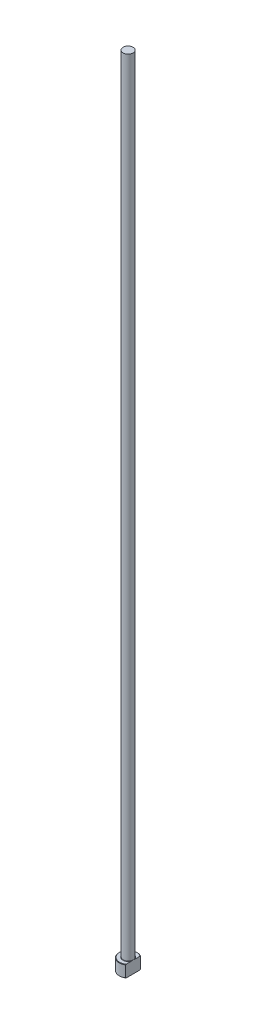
ISO-10303-21;
HEADER;
FILE_DESCRIPTION(('STEP AP214'),'2;1');
FILE_NAME('part.step','',(''),(''),'','','');
FILE_SCHEMA(('AUTOMOTIVE_DESIGN { 1 0 10303 214 1 1 1 1 }'));
ENDSEC;
DATA;
#1=APPLICATION_CONTEXT('core data for automotive mechanical design processes');
#2=APPLICATION_PROTOCOL_DEFINITION('international standard','automotive_design',2000,#1);
#3=PRODUCT_CONTEXT('',#1,'mechanical');
#4=PRODUCT('Part','Part','',(#3));
#5=PRODUCT_RELATED_PRODUCT_CATEGORY('part','',(#4));
#6=PRODUCT_DEFINITION_FORMATION('','',#4);
#7=PRODUCT_DEFINITION_CONTEXT('part definition',#1,'design');
#8=PRODUCT_DEFINITION('design','',#6,#7);
#9=PRODUCT_DEFINITION_SHAPE('','',#8);
#10=(LENGTH_UNIT() NAMED_UNIT(*) SI_UNIT(.MILLI.,.METRE.));
#11=(NAMED_UNIT(*) PLANE_ANGLE_UNIT() SI_UNIT($,.RADIAN.));
#12=(NAMED_UNIT(*) SI_UNIT($,.STERADIAN.) SOLID_ANGLE_UNIT());
#13=UNCERTAINTY_MEASURE_WITH_UNIT(LENGTH_MEASURE(1.E-05),#10,'distance_accuracy_value','');
#14=(GEOMETRIC_REPRESENTATION_CONTEXT(3) GLOBAL_UNCERTAINTY_ASSIGNED_CONTEXT((#13)) GLOBAL_UNIT_ASSIGNED_CONTEXT((#10,
#11,#12)) REPRESENTATION_CONTEXT('',''));
#15=CARTESIAN_POINT('',(0.,0.,0.));
#16=DIRECTION('',(0.,0.,1.));
#17=DIRECTION('',(1.,0.,0.));
#18=AXIS2_PLACEMENT_3D('',#15,#16,#17);
#19=CARTESIAN_POINT('',(0.,0.,0.));
#20=DIRECTION('',(0.,-1.,0.));
#21=DIRECTION('',(0.,0.,-1.));
#22=AXIS2_PLACEMENT_3D('',#19,#20,#21);
#23=PLANE('',#22);
#24=CARTESIAN_POINT('',(0.,0.,0.));
#25=DIRECTION('',(0.,-1.,0.));
#26=DIRECTION('',(0.,0.,-1.));
#27=AXIS2_PLACEMENT_3D('',#24,#25,#26);
#28=CIRCLE('',#27,4.29999999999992);
#29=CARTESIAN_POINT('',(2.49999999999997,0.,3.4985711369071));
#30=VERTEX_POINT('',#29);
#31=CARTESIAN_POINT('',(2.49999999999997,0.,-3.4985711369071));
#32=VERTEX_POINT('',#31);
#33=EDGE_CURVE('E98',#30,#32,#28,.T.);
#34=ORIENTED_EDGE('',*,*,#33,.T.);
#35=DIRECTION('',(0.,0.,1.));
#36=VECTOR('',#35,1.);
#37=CARTESIAN_POINT('',(2.49999999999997,0.,3.74165738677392));
#38=LINE('',#37,#36);
#39=EDGE_CURVE('E83',#32,#30,#38,.T.);
#40=ORIENTED_EDGE('',*,*,#39,.T.);
#41=EDGE_LOOP('',(#34,#40));
#42=FACE_BOUND('',#41,.T.);
#43=ADVANCED_FACE('F32',(#42),#23,.T.);
#44=CARTESIAN_POINT('',(0.,259.958771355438,0.));
#45=DIRECTION('',(0.,1.,0.));
#46=DIRECTION('',(0.,0.,1.));
#47=AXIS2_PLACEMENT_3D('',#44,#45,#46);
#48=CYLINDRICAL_SURFACE('',#47,4.49999999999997);
#49=CARTESIAN_POINT('',(0.,5.80000000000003,0.));
#50=DIRECTION('',(0.,1.,0.));
#51=DIRECTION('',(0.,0.,1.));
#52=AXIS2_PLACEMENT_3D('',#49,#50,#51);
#53=CIRCLE('',#52,4.49999999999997);
#54=CARTESIAN_POINT('',(2.49999999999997,5.80000000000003,3.74165738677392));
#55=VERTEX_POINT('',#54);
#56=CARTESIAN_POINT('',(2.49999999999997,5.80000000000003,-3.74165738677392));
#57=VERTEX_POINT('',#56);
#58=EDGE_CURVE('E104',#55,#57,#53,.F.);
#59=ORIENTED_EDGE('',*,*,#58,.T.);
#60=DIRECTION('',(0.,-1.,0.));
#61=VECTOR('',#60,1.);
#62=CARTESIAN_POINT('',(2.49999999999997,400.,-3.74165738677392));
#63=LINE('',#62,#61);
#64=CARTESIAN_POINT('',(2.49999999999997,0.199999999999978,-3.74165738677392));
#65=VERTEX_POINT('',#64);
#66=EDGE_CURVE('E183',#57,#65,#63,.T.);
#67=ORIENTED_EDGE('',*,*,#66,.T.);
#68=CARTESIAN_POINT('',(0.,0.199999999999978,0.));
#69=DIRECTION('',(0.,-1.,0.));
#70=DIRECTION('',(0.,0.,-1.));
#71=AXIS2_PLACEMENT_3D('',#68,#69,#70);
#72=CIRCLE('',#71,4.49999999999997);
#73=CARTESIAN_POINT('',(2.49999999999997,0.199999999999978,3.74165738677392));
#74=VERTEX_POINT('',#73);
#75=EDGE_CURVE('E100',#65,#74,#72,.F.);
#76=ORIENTED_EDGE('',*,*,#75,.T.);
#77=DIRECTION('',(0.,-1.,0.));
#78=VECTOR('',#77,1.);
#79=CARTESIAN_POINT('',(2.49999999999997,400.,3.74165738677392));
#80=LINE('',#79,#78);
#81=EDGE_CURVE('E93',#55,#74,#80,.T.);
#82=ORIENTED_EDGE('',*,*,#81,.F.);
#83=EDGE_LOOP('',(#59,#67,#76,#82));
#84=FACE_BOUND('',#83,.T.);
#85=ADVANCED_FACE('F158',(#84),#48,.T.);
#86=CARTESIAN_POINT('',(-4.49999999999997,6.,0.));
#87=DIRECTION('',(0.,1.,0.));
#88=DIRECTION('',(0.,0.,1.));
#89=AXIS2_PLACEMENT_3D('',#86,#87,#88);
#90=PLANE('',#89);
#91=CARTESIAN_POINT('',(0.,6.,0.));
#92=DIRECTION('',(0.,1.,0.));
#93=DIRECTION('',(0.,0.,1.));
#94=AXIS2_PLACEMENT_3D('',#91,#92,#93);
#95=CIRCLE('',#94,4.29999999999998);
#96=CARTESIAN_POINT('',(2.49999999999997,6.,-3.49857113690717));
#97=VERTEX_POINT('',#96);
#98=CARTESIAN_POINT('',(2.49999999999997,6.,3.49857113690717));
#99=VERTEX_POINT('',#98);
#100=EDGE_CURVE('E178',#97,#99,#95,.T.);
#101=ORIENTED_EDGE('',*,*,#100,.T.);
#102=DIRECTION('',(0.,0.,-1.));
#103=VECTOR('',#102,1.);
#104=CARTESIAN_POINT('',(2.49999999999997,6.,0.));
#105=LINE('',#104,#103);
#106=CARTESIAN_POINT('',(2.49999999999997,5.99999999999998,1.01980390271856));
#107=VERTEX_POINT('',#106);
#108=EDGE_CURVE('E57',#99,#107,#105,.T.);
#109=ORIENTED_EDGE('',*,*,#108,.T.);
#110=CARTESIAN_POINT('',(0.,6.,0.));
#111=DIRECTION('',(0.,1.,0.));
#112=DIRECTION('',(0.,0.,1.));
#113=AXIS2_PLACEMENT_3D('',#110,#111,#112);
#114=CIRCLE('',#113,2.69999999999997);
#115=CARTESIAN_POINT('',(2.49999999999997,5.99999999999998,-1.01980390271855));
#116=VERTEX_POINT('',#115);
#117=EDGE_CURVE('E107',#107,#116,#114,.F.);
#118=ORIENTED_EDGE('',*,*,#117,.T.);
#119=EDGE_CURVE('E136',#116,#97,#105,.T.);
#120=ORIENTED_EDGE('',*,*,#119,.T.);
#121=EDGE_LOOP('',(#101,#109,#118,#120));
#122=FACE_BOUND('',#121,.T.);
#123=ADVANCED_FACE('F147',(#122),#90,.T.);
#124=CARTESIAN_POINT('',(0.,6.00000000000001,0.));
#125=DIRECTION('',(0.,-1.,0.));
#126=DIRECTION('',(0.,0.,-1.));
#127=AXIS2_PLACEMENT_3D('',#124,#125,#126);
#128=CONICAL_SURFACE('',#127,4.29999999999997,0.785398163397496);
#129=ORIENTED_EDGE('',*,*,#58,.F.);
#130=CARTESIAN_POINT('',(2.49999999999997,1.69536803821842,8.233449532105));
#131=CARTESIAN_POINT('',(2.49999999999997,1.84159559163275,8.08062583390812));
#132=CARTESIAN_POINT('',(2.49999999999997,1.98764793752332,7.92763429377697));
#133=CARTESIAN_POINT('',(2.49999999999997,2.27932845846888,7.62124541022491));
#134=CARTESIAN_POINT('',(2.49999999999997,2.4249566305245,7.46784806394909));
#135=CARTESIAN_POINT('',(2.49999999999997,2.86116481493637,7.0068675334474));
#136=CARTESIAN_POINT('',(2.49999999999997,3.15099433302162,6.69857321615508));
#137=CARTESIAN_POINT('',(2.49999999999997,3.72884985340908,6.07807253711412));
#138=CARTESIAN_POINT('',(2.49999999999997,4.01686464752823,5.76585569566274));
#139=CARTESIAN_POINT('',(2.49999999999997,4.44539957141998,5.29439081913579));
#140=CARTESIAN_POINT('',(2.49999999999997,4.58765535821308,5.1367216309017));
#141=CARTESIAN_POINT('',(2.49999999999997,4.87066186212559,4.8200396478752));
#142=CARTESIAN_POINT('',(2.49999999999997,5.011412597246,4.66102686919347));
#143=CARTESIAN_POINT('',(2.49999999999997,5.29570787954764,4.33582683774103));
#144=CARTESIAN_POINT('',(2.49999999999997,5.43918418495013,4.16957975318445));
#145=CARTESIAN_POINT('',(2.49999999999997,5.72327592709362,3.83461659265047));
#146=CARTESIAN_POINT('',(2.49999999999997,5.86389099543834,3.66590020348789));
#147=CARTESIAN_POINT('',(2.49999999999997,6.14107420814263,3.32513857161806));
#148=CARTESIAN_POINT('',(2.49999999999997,6.27764223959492,3.15309323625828));
#149=CARTESIAN_POINT('',(2.49999999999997,6.47795110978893,2.89156777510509));
#150=CARTESIAN_POINT('',(2.49999999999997,6.5439576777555,2.80382460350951));
#151=CARTESIAN_POINT('',(2.49999999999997,6.67408242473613,2.62695176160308));
#152=CARTESIAN_POINT('',(2.49999999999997,6.73820069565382,2.5378221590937));
#153=CARTESIAN_POINT('',(2.49999999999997,6.87152528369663,2.34725612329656));
#154=CARTESIAN_POINT('',(2.49999999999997,6.94043579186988,2.24561149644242));
#155=CARTESIAN_POINT('',(2.49999999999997,7.07436956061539,2.0398042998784));
#156=CARTESIAN_POINT('',(2.49999999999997,7.13939350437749,1.93564217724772));
#157=CARTESIAN_POINT('',(2.49999999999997,7.26425850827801,1.72423874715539));
#158=CARTESIAN_POINT('',(2.49999999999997,7.32410048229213,1.61699798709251));
#159=CARTESIAN_POINT('',(2.49999999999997,7.43673687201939,1.39892979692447));
#160=CARTESIAN_POINT('',(2.49999999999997,7.48953435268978,1.28810395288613));
#161=CARTESIAN_POINT('',(2.49999999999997,7.60157711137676,1.02468144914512));
#162=CARTESIAN_POINT('',(2.49999999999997,7.65714985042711,0.870425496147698));
#163=CARTESIAN_POINT('',(2.49999999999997,7.72191807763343,0.634205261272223));
#164=CARTESIAN_POINT('',(2.49999999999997,7.74039604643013,0.554773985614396));
#165=CARTESIAN_POINT('',(2.49999999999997,7.77027635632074,0.394570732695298));
#166=CARTESIAN_POINT('',(2.49999999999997,7.78167951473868,0.313798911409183));
#167=CARTESIAN_POINT('',(2.49999999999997,7.79679993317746,0.150603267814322));
#168=CARTESIAN_POINT('',(2.49999999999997,7.80042867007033,0.0681710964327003));
#169=CARTESIAN_POINT('',(2.49999999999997,7.79949026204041,-0.0966436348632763));
#170=CARTESIAN_POINT('',(2.49999999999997,7.79492331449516,-0.179026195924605));
#171=CARTESIAN_POINT('',(2.49999999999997,7.77788997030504,-0.343090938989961));
#172=CARTESIAN_POINT('',(2.49999999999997,7.76541077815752,-0.424771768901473));
#173=CARTESIAN_POINT('',(2.49999999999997,7.73330588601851,-0.586708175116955));
#174=CARTESIAN_POINT('',(2.49999999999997,7.71367845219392,-0.66696340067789));
#175=CARTESIAN_POINT('',(2.49999999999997,7.65833470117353,-0.860438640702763));
#176=CARTESIAN_POINT('',(2.49999999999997,7.61933642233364,-0.972715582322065));
#177=CARTESIAN_POINT('',(2.49999999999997,7.53162689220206,-1.19338710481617));
#178=CARTESIAN_POINT('',(2.49999999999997,7.48290892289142,-1.30177893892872));
#179=CARTESIAN_POINT('',(2.49999999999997,7.37798916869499,-1.51554087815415));
#180=CARTESIAN_POINT('',(2.49999999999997,7.32174953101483,-1.62089218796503));
#181=CARTESIAN_POINT('',(2.49999999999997,7.23334776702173,-1.77656150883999));
#182=CARTESIAN_POINT('',(2.49999999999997,7.20321149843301,-1.82805098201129));
#183=CARTESIAN_POINT('',(2.49999999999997,7.14176188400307,-1.93032073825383));
#184=CARTESIAN_POINT('',(2.49999999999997,7.11044858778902,-1.98110105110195));
#185=CARTESIAN_POINT('',(2.49999999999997,7.0042870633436,-2.14944611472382));
#186=CARTESIAN_POINT('',(2.49999999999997,6.92717470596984,-2.26558431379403));
#187=CARTESIAN_POINT('',(2.49999999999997,6.76891329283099,-2.49508800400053));
#188=CARTESIAN_POINT('',(2.49999999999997,6.68776326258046,-2.60845281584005));
#189=CARTESIAN_POINT('',(2.49999999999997,6.52238824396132,-2.83304153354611));
#190=CARTESIAN_POINT('',(2.49999999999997,6.43816097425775,-2.94426375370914));
#191=CARTESIAN_POINT('',(2.49999999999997,6.26739791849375,-3.1649260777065));
#192=CARTESIAN_POINT('',(2.49999999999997,6.18086198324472,-3.27436606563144));
#193=CARTESIAN_POINT('',(2.49999999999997,6.00577178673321,-3.49207549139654));
#194=CARTESIAN_POINT('',(2.49999999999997,5.91721294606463,-3.60034123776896));
#195=CARTESIAN_POINT('',(2.49999999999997,5.73865921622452,-3.81568349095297));
#196=CARTESIAN_POINT('',(2.49999999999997,5.64866429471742,-3.92275997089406));
#197=CARTESIAN_POINT('',(2.49999999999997,5.37704561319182,-4.24242567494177));
#198=CARTESIAN_POINT('',(2.49999999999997,5.19370393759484,-4.45355444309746));
#199=CARTESIAN_POINT('',(2.49999999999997,4.82367634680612,-4.87338717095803));
#200=CARTESIAN_POINT('',(2.49999999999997,4.63698598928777,-5.08208719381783));
#201=CARTESIAN_POINT('',(2.49999999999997,4.26138721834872,-5.49751911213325));
#202=CARTESIAN_POINT('',(2.49999999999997,4.07247857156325,-5.70425079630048));
#203=CARTESIAN_POINT('',(2.49999999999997,3.69329624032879,-6.11595801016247));
#204=CARTESIAN_POINT('',(2.49999999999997,3.50302465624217,-6.32093547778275));
#205=CARTESIAN_POINT('',(2.49999999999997,3.12126439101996,-6.72975403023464));
#206=CARTESIAN_POINT('',(2.49999999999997,2.92977570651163,-6.93359511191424));
#207=CARTESIAN_POINT('',(2.49999999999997,2.65119470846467,-7.2287714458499));
#208=CARTESIAN_POINT('',(2.49999999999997,2.56447790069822,-7.32046158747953));
#209=CARTESIAN_POINT('',(2.49999999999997,2.39085496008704,-7.50369470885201));
#210=CARTESIAN_POINT('',(2.49999999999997,2.30394879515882,-7.59523765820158));
#211=CARTESIAN_POINT('',(2.49999999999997,2.13016920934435,-7.77797738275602));
#212=CARTESIAN_POINT('',(2.49999999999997,2.04329612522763,-7.86917447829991));
#213=CARTESIAN_POINT('',(2.49999999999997,1.86942568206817,-8.0514176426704));
#214=CARTESIAN_POINT('',(2.49999999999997,1.78242834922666,-8.14246373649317));
#215=CARTESIAN_POINT('',(2.49999999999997,1.69536803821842,-8.233449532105));
#216=B_SPLINE_CURVE_WITH_KNOTS('',3,(#130,#131,#132,#133,#134,#135,#136,#137,#138,#139,#140,
#141,#142,#143,#144,#145,#146,#147,#148,#149,#150,#151,#152,#153,#154,#155,#156,#157,#158,#159,
#160,#161,#162,#163,#164,#165,#166,#167,#168,#169,#170,#171,#172,#173,#174,#175,#176,#177,#178,
#179,#180,#181,#182,#183,#184,#185,#186,#187,#188,#189,#190,#191,#192,#193,#194,#195,#196,#197,
#198,#199,#200,#201,#202,#203,#204,#205,#206,#207,#208,#209,#210,#211,#212,#213,#214,#215),
.UNSPECIFIED.,.F.,.F.,(4,2,2,2,2,2,2,2,2,2,2,2,2,2,2,2,2,2,2,2,2,2,2,2,2,2,2,2,2,2,2,2,2,2,2,2,
2,2,2,2,2,2,4),(0.,0.63453779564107,1.26908006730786,2.53848610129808,3.81276948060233,
4.44983884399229,5.08690057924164,5.74567154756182,6.40452680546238,7.06340042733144,
7.39277668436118,7.72213688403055,8.09047335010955,8.45874487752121,8.82695132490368,
9.19499704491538,9.68515232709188,9.92954493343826,10.1739093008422,10.4210416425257,
10.6681680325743,10.9156950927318,11.163282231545,11.5192140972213,11.8753928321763,
12.2334366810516,12.4124062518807,12.591368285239,13.0094573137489,13.427647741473,
13.8461547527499,14.2646888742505,14.6842890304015,15.1038986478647,15.942718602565,
16.7827484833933,17.6228675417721,18.4618914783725,19.300917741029,19.6795229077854,
20.0581981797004,20.4360532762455,20.8138378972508),.UNSPECIFIED.);
#217=EDGE_CURVE('E135',#55,#99,#216,.T.);
#218=ORIENTED_EDGE('',*,*,#217,.T.);
#219=ORIENTED_EDGE('',*,*,#100,.F.);
#220=EDGE_CURVE('E127',#97,#57,#216,.T.);
#221=ORIENTED_EDGE('',*,*,#220,.T.);
#222=EDGE_LOOP('',(#129,#218,#219,#221));
#223=FACE_BOUND('',#222,.T.);
#224=ADVANCED_FACE('F143',(#223),#128,.T.);
#225=CARTESIAN_POINT('',(0.,0.199999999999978,0.));
#226=DIRECTION('',(0.,1.,0.));
#227=DIRECTION('',(0.,0.,1.));
#228=AXIS2_PLACEMENT_3D('',#225,#226,#227);
#229=CONICAL_SURFACE('',#228,4.49999999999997,0.785398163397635);
#230=ORIENTED_EDGE('',*,*,#75,.F.);
#231=CARTESIAN_POINT('',(2.49999999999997,4.30463196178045,-8.233449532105));
#232=CARTESIAN_POINT('',(2.49999999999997,4.15840440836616,-8.08062583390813));
#233=CARTESIAN_POINT('',(2.49999999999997,4.01235206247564,-7.92763429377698));
#234=CARTESIAN_POINT('',(2.49999999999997,3.72067154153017,-7.62124541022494));
#235=CARTESIAN_POINT('',(2.49999999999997,3.5750433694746,-7.46784806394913));
#236=CARTESIAN_POINT('',(2.49999999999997,3.13883518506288,-7.00686753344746));
#237=CARTESIAN_POINT('',(2.49999999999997,2.84900566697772,-6.69857321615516));
#238=CARTESIAN_POINT('',(2.49999999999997,2.27115014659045,-6.07807253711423));
#239=CARTESIAN_POINT('',(2.49999999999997,1.98313535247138,-5.76585569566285));
#240=CARTESIAN_POINT('',(2.49999999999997,1.55460042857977,-5.29439081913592));
#241=CARTESIAN_POINT('',(2.49999999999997,1.41234464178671,-5.13672163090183));
#242=CARTESIAN_POINT('',(2.49999999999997,1.12933813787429,-4.82003964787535));
#243=CARTESIAN_POINT('',(2.49999999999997,0.988587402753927,-4.66102686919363));
#244=CARTESIAN_POINT('',(2.49999999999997,0.704292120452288,-4.33582683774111));
#245=CARTESIAN_POINT('',(2.49999999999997,0.560815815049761,-4.16957975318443));
#246=CARTESIAN_POINT('',(2.49999999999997,0.276724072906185,-3.83461659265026));
#247=CARTESIAN_POINT('',(2.49999999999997,0.136109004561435,-3.66590020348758));
#248=CARTESIAN_POINT('',(2.49999999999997,-0.141074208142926,-3.32513857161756));
#249=CARTESIAN_POINT('',(2.49999999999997,-0.277642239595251,-3.15309323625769));
#250=CARTESIAN_POINT('',(2.49999999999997,-0.477951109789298,-2.89156777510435));
#251=CARTESIAN_POINT('',(2.49999999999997,-0.543957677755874,-2.80382460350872));
#252=CARTESIAN_POINT('',(2.49999999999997,-0.674082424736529,-2.62695176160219));
#253=CARTESIAN_POINT('',(2.49999999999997,-0.738200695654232,-2.53782215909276));
#254=CARTESIAN_POINT('',(2.49999999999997,-0.871525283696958,-2.34725612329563));
#255=CARTESIAN_POINT('',(2.49999999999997,-0.940435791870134,-2.24561149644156));
#256=CARTESIAN_POINT('',(2.49999999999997,-1.07436956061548,-2.03980429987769));
#257=CARTESIAN_POINT('',(2.49999999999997,-1.1393935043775,-1.93564217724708));
#258=CARTESIAN_POINT('',(2.49999999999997,-1.26425850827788,-1.7242387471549));
#259=CARTESIAN_POINT('',(2.49999999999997,-1.32410048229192,-1.61699798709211));
#260=CARTESIAN_POINT('',(2.49999999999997,-1.43673687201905,-1.39892979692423));
#261=CARTESIAN_POINT('',(2.49999999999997,-1.48953435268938,-1.28810395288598));
#262=CARTESIAN_POINT('',(2.49999999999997,-1.6015771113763,-1.024681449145));
#263=CARTESIAN_POINT('',(2.49999999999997,-1.65714985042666,-0.870425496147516));
#264=CARTESIAN_POINT('',(2.49999999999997,-1.72191807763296,-0.634205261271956));
#265=CARTESIAN_POINT('',(2.49999999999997,-1.74039604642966,-0.5547739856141));
#266=CARTESIAN_POINT('',(2.49999999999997,-1.77027635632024,-0.394570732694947));
#267=CARTESIAN_POINT('',(2.49999999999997,-1.78167951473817,-0.313798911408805));
#268=CARTESIAN_POINT('',(2.49999999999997,-1.79679993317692,-0.150603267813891));
#269=CARTESIAN_POINT('',(2.49999999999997,-1.80042867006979,-0.0681710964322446));
#270=CARTESIAN_POINT('',(2.49999999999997,-1.79949026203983,0.0966436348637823));
#271=CARTESIAN_POINT('',(2.49999999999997,-1.79492331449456,0.179026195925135));
#272=CARTESIAN_POINT('',(2.49999999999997,-1.77788997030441,0.343090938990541));
#273=CARTESIAN_POINT('',(2.49999999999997,-1.76541077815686,0.424771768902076));
#274=CARTESIAN_POINT('',(2.49999999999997,-1.73330588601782,0.586708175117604));
#275=CARTESIAN_POINT('',(2.49999999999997,-1.71367845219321,0.666963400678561));
#276=CARTESIAN_POINT('',(2.49999999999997,-1.65833470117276,0.860438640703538));
#277=CARTESIAN_POINT('',(2.49999999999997,-1.61933642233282,0.972715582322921));
#278=CARTESIAN_POINT('',(2.49999999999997,-1.53162689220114,1.19338710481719));
#279=CARTESIAN_POINT('',(2.49999999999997,-1.48290892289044,1.30177893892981));
#280=CARTESIAN_POINT('',(2.49999999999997,-1.3779891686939,1.5155408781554));
#281=CARTESIAN_POINT('',(2.49999999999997,-1.32174953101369,1.62089218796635));
#282=CARTESIAN_POINT('',(2.49999999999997,-1.2333477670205,1.77656150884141));
#283=CARTESIAN_POINT('',(2.49999999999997,-1.20321149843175,1.82805098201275));
#284=CARTESIAN_POINT('',(2.49999999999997,-1.14176188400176,1.93032073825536));
#285=CARTESIAN_POINT('',(2.49999999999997,-1.11044858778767,1.98110105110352));
#286=CARTESIAN_POINT('',(2.49999999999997,-1.00428706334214,2.14944611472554));
#287=CARTESIAN_POINT('',(2.49999999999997,-0.927174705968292,2.26558431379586));
#288=CARTESIAN_POINT('',(2.49999999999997,-0.768913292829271,2.49508800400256));
#289=CARTESIAN_POINT('',(2.49999999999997,-0.687763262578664,2.6084528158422));
#290=CARTESIAN_POINT('',(2.49999999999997,-0.522388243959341,2.83304153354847));
#291=CARTESIAN_POINT('',(2.49999999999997,-0.438160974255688,2.94426375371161));
#292=CARTESIAN_POINT('',(2.49999999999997,-0.267397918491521,3.16492607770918));
#293=CARTESIAN_POINT('',(2.49999999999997,-0.180861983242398,3.27436606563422));
#294=CARTESIAN_POINT('',(2.49999999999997,-0.00577178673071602,3.49207549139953));
#295=CARTESIAN_POINT('',(2.49999999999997,0.0827870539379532,3.60034123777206));
#296=CARTESIAN_POINT('',(2.49999999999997,0.261340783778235,3.81568349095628));
#297=CARTESIAN_POINT('',(2.49999999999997,0.351335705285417,3.92275997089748));
#298=CARTESIAN_POINT('',(2.49999999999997,0.622954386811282,4.2424256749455));
#299=CARTESIAN_POINT('',(2.49999999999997,0.806296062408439,4.45355444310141));
#300=CARTESIAN_POINT('',(2.49999999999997,1.1763236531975,4.8733871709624));
#301=CARTESIAN_POINT('',(2.49999999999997,1.36301401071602,5.0820871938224));
#302=CARTESIAN_POINT('',(2.49999999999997,1.73861278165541,5.49751911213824));
#303=CARTESIAN_POINT('',(2.49999999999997,1.92752142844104,5.70425079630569));
#304=CARTESIAN_POINT('',(2.49999999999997,2.30670375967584,6.1159580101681));
#305=CARTESIAN_POINT('',(2.49999999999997,2.49697534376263,6.32093547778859));
#306=CARTESIAN_POINT('',(2.49999999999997,2.87873560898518,6.72975403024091));
#307=CARTESIAN_POINT('',(2.49999999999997,3.07022429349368,6.93359511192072));
#308=CARTESIAN_POINT('',(2.49999999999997,3.34880529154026,7.22877144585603));
#309=CARTESIAN_POINT('',(2.49999999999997,3.43552209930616,7.3204615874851));
#310=CARTESIAN_POINT('',(2.49999999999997,3.60914503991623,7.50369470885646));
#311=CARTESIAN_POINT('',(2.49999999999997,3.69605120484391,7.59523765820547));
#312=CARTESIAN_POINT('',(2.49999999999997,3.86983079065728,7.77797738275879));
#313=CARTESIAN_POINT('',(2.49999999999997,3.95670387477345,7.86917447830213));
#314=CARTESIAN_POINT('',(2.49999999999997,4.1305743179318,8.05141764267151));
#315=CARTESIAN_POINT('',(2.49999999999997,4.21757165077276,8.14246373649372));
#316=CARTESIAN_POINT('',(2.49999999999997,4.30463196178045,8.233449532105));
#317=B_SPLINE_CURVE_WITH_KNOTS('',3,(#231,#232,#233,#234,#235,#236,#237,#238,#239,#240,#241,
#242,#243,#244,#245,#246,#247,#248,#249,#250,#251,#252,#253,#254,#255,#256,#257,#258,#259,#260,
#261,#262,#263,#264,#265,#266,#267,#268,#269,#270,#271,#272,#273,#274,#275,#276,#277,#278,#279,
#280,#281,#282,#283,#284,#285,#286,#287,#288,#289,#290,#291,#292,#293,#294,#295,#296,#297,#298,
#299,#300,#301,#302,#303,#304,#305,#306,#307,#308,#309,#310,#311,#312,#313,#314,#315,#316),
.UNSPECIFIED.,.F.,.F.,(4,2,2,2,2,2,2,2,2,2,2,2,2,2,2,2,2,2,2,2,2,2,2,2,2,2,2,2,2,2,2,2,2,2,2,2,
2,2,2,2,2,2,4),(0.,0.634537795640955,1.26908006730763,2.53848610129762,3.81276948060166,
4.44983884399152,5.08690057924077,5.74567154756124,6.40452680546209,7.06340042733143,
7.39277668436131,7.72213688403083,8.09047335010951,8.45874487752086,8.82695132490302,
9.19499704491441,9.68515232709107,9.92954493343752,10.1739093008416,10.4210416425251,
10.6681680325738,10.9156950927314,11.1632822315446,11.5192140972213,11.8753928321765,
12.2334366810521,12.4124062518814,12.5913682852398,13.00945731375,13.4276477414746,
13.8461547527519,14.2646888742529,14.6842890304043,15.1038986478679,15.9427186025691,
16.7827484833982,17.6228675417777,18.4618914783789,19.3009177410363,19.6795229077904,
20.058198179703,20.4360532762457,20.8138378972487),.UNSPECIFIED.);
#318=EDGE_CURVE('E86',#65,#32,#317,.T.);
#319=ORIENTED_EDGE('',*,*,#318,.T.);
#320=ORIENTED_EDGE('',*,*,#33,.F.);
#321=EDGE_CURVE('E89',#30,#74,#317,.T.);
#322=ORIENTED_EDGE('',*,*,#321,.T.);
#323=EDGE_LOOP('',(#230,#319,#320,#322));
#324=FACE_BOUND('',#323,.T.);
#325=ADVANCED_FACE('F97',(#324),#229,.T.);
#326=CARTESIAN_POINT('',(0.,6.19999999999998,0.));
#327=DIRECTION('',(0.,1.,0.));
#328=DIRECTION('',(0.,0.,1.));
#329=AXIS2_PLACEMENT_3D('',#326,#327,#328);
#330=TOROIDAL_SURFACE('',#329,2.69999999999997,0.2);
#331=CARTESIAN_POINT('',(2.49999999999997,6.19999999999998,0.));
#332=CARTESIAN_POINT('',(2.49999999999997,6.20000050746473,5.29061779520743E-11));
#333=CARTESIAN_POINT('',(2.49999999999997,6.20000101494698,-1.70517167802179E-07));
#334=CARTESIAN_POINT('',(2.49999999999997,6.20000196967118,-6.59443828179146E-07));
#335=CARTESIAN_POINT('',(2.49999999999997,6.20000240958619,-9.87883952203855E-07));
#336=CARTESIAN_POINT('',(2.49999999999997,6.20000331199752,-1.77246896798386E-06));
#337=CARTESIAN_POINT('',(2.49999999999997,6.20000376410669,-2.24097233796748E-06));
#338=CARTESIAN_POINT('',(2.49999999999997,6.20000458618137,-3.22186062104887E-06));
#339=CARTESIAN_POINT('',(2.49999999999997,6.20000495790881,-3.73286591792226E-06));
#340=CARTESIAN_POINT('',(2.49999999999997,6.20000630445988,-5.67453790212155E-06));
#341=CARTESIAN_POINT('',(2.49999999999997,6.20000720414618,-7.15943636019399E-06));
#342=CARTESIAN_POINT('',(2.49999999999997,6.2000087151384,-1.01304384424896E-05));
#343=CARTESIAN_POINT('',(2.49999999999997,6.20000934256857,-1.16087238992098E-05));
#344=CARTESIAN_POINT('',(2.49999999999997,6.2000119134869,-1.77555557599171E-05));
#345=CARTESIAN_POINT('',(2.49999999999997,6.20001378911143,-2.24564508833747E-05));
#346=CARTESIAN_POINT('',(2.49999999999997,6.20001661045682,-3.14167104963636E-05));
#347=CARTESIAN_POINT('',(2.49999999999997,6.20001764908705,-3.56468505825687E-05));
#348=CARTESIAN_POINT('',(2.49999999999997,6.20002511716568,-6.67543466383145E-05));
#349=CARTESIAN_POINT('',(2.49999999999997,6.20003067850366,-9.37930231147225E-05));
#350=CARTESIAN_POINT('',(2.49999999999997,6.20005501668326,-0.000200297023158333));
#351=CARTESIAN_POINT('',(2.49999999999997,6.20007833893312,-0.000278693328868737));
#352=CARTESIAN_POINT('',(2.49999999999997,6.20016883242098,-0.000588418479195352));
#353=CARTESIAN_POINT('',(2.49999999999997,6.20023298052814,-0.000820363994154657));
#354=CARTESIAN_POINT('',(2.49999999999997,6.20048923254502,-0.00173961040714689));
#355=CARTESIAN_POINT('',(2.49999999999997,6.20068508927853,-0.00242612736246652));
#356=CARTESIAN_POINT('',(2.49999999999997,6.20149752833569,-0.00528196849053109));
#357=CARTESIAN_POINT('',(2.49999999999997,6.20210941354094,-0.00745227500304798));
#358=CARTESIAN_POINT('',(2.49999999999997,6.20774599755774,-0.0274346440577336));
#359=CARTESIAN_POINT('',(2.49999999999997,6.21279017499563,-0.0452427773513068));
#360=CARTESIAN_POINT('',(2.49999999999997,6.22264347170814,-0.0801677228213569));
#361=CARTESIAN_POINT('',(2.49999999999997,6.22745402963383,-0.0972841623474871));
#362=CARTESIAN_POINT('',(2.49999999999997,6.23763483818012,-0.133672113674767));
#363=CARTESIAN_POINT('',(2.49999999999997,6.24299975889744,-0.152945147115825));
#364=CARTESIAN_POINT('',(2.49999999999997,6.25370389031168,-0.19172222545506));
#365=CARTESIAN_POINT('',(2.49999999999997,6.25904219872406,-0.211226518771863));
#366=CARTESIAN_POINT('',(2.49999999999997,6.27184445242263,-0.258540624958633));
#367=CARTESIAN_POINT('',(2.49999999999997,6.27925018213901,-0.286366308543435));
#368=CARTESIAN_POINT('',(2.49999999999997,6.2935514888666,-0.341371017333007));
#369=CARTESIAN_POINT('',(2.49999999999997,6.30045534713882,-0.368547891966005));
#370=CARTESIAN_POINT('',(2.49999999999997,6.3199112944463,-0.447507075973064));
#371=CARTESIAN_POINT('',(2.49999999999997,6.3319536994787,-0.499417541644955));
#372=CARTESIAN_POINT('',(2.49999999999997,6.35404241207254,-0.60418810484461));
#373=CARTESIAN_POINT('',(2.49999999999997,6.36406867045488,-0.657052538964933));
#374=CARTESIAN_POINT('',(2.49999999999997,6.38176575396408,-0.767598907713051));
#375=CARTESIAN_POINT('',(2.49999999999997,6.38917909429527,-0.825323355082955));
#376=CARTESIAN_POINT('',(2.49999999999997,6.39884096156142,-0.941055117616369));
#377=CARTESIAN_POINT('',(2.49999999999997,6.40111055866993,-0.999060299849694));
#378=CARTESIAN_POINT('',(2.49999999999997,6.39847691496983,-1.09324578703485));
#379=CARTESIAN_POINT('',(2.49999999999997,6.39593644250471,-1.12948454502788));
#380=CARTESIAN_POINT('',(2.49999999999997,6.38674319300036,-1.20096926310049));
#381=CARTESIAN_POINT('',(2.49999999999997,6.38015410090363,-1.23622192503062));
#382=CARTESIAN_POINT('',(2.49999999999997,6.36639936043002,-1.28579148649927));
#383=CARTESIAN_POINT('',(2.49999999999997,6.36162670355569,-1.30076836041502));
#384=CARTESIAN_POINT('',(2.49999999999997,6.35062798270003,-1.33028325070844));
#385=CARTESIAN_POINT('',(2.49999999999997,6.34439458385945,-1.34481861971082));
#386=CARTESIAN_POINT('',(2.49999999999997,6.33003808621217,-1.37319413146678));
#387=CARTESIAN_POINT('',(2.49999999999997,6.32189015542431,-1.38702194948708));
#388=CARTESIAN_POINT('',(2.49999999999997,6.30325367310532,-1.41298115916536));
#389=CARTESIAN_POINT('',(2.49999999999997,6.29278241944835,-1.42512406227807));
#390=CARTESIAN_POINT('',(2.49999999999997,6.27569207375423,-1.44029611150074));
#391=CARTESIAN_POINT('',(2.49999999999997,6.27021837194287,-1.44461019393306));
#392=CARTESIAN_POINT('',(2.49999999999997,6.25870897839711,-1.45242709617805));
#393=CARTESIAN_POINT('',(2.49999999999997,6.25267333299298,-1.45592998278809));
#394=CARTESIAN_POINT('',(2.49999999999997,6.24001938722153,-1.46191450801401));
#395=CARTESIAN_POINT('',(2.49999999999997,6.23339520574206,-1.46438399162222));
#396=CARTESIAN_POINT('',(2.49999999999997,6.2197934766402,-1.46798853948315));
#397=CARTESIAN_POINT('',(2.49999999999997,6.21281651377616,-1.46912574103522));
#398=CARTESIAN_POINT('',(2.49999999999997,6.19961348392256,-1.46988240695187));
#399=CARTESIAN_POINT('',(2.49999999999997,6.19339654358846,-1.46966594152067));
#400=CARTESIAN_POINT('',(2.49999999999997,6.18110362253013,-1.46811597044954));
#401=CARTESIAN_POINT('',(2.49999999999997,6.17502769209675,-1.46678207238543));
#402=CARTESIAN_POINT('',(2.49999999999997,6.16354702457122,-1.46323301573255));
#403=CARTESIAN_POINT('',(2.49999999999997,6.15812390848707,-1.46107586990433));
#404=CARTESIAN_POINT('',(2.49999999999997,6.14763458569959,-1.45603007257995));
#405=CARTESIAN_POINT('',(2.49999999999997,6.14256845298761,-1.45314127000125));
#406=CARTESIAN_POINT('',(2.49999999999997,6.12963191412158,-1.4446884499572));
#407=CARTESIAN_POINT('',(2.49999999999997,6.12209714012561,-1.43861122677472));
#408=CARTESIAN_POINT('',(2.49999999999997,6.10805350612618,-1.42536327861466));
#409=CARTESIAN_POINT('',(2.49999999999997,6.10154826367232,-1.41818886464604));
#410=CARTESIAN_POINT('',(2.49999999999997,6.08513615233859,-1.39772885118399));
#411=CARTESIAN_POINT('',(2.49999999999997,6.07611692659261,-1.38373739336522));
#412=CARTESIAN_POINT('',(2.49999999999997,6.06018433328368,-1.35465370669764));
#413=CARTESIAN_POINT('',(2.49999999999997,6.05327247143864,-1.33956070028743));
#414=CARTESIAN_POINT('',(2.49999999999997,6.04107204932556,-1.30868385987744));
#415=CARTESIAN_POINT('',(2.49999999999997,6.03578911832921,-1.29289784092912));
#416=CARTESIAN_POINT('',(2.49999999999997,6.02655583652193,-1.26093375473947));
#417=CARTESIAN_POINT('',(2.49999999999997,6.02260692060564,-1.24475528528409));
#418=CARTESIAN_POINT('',(2.49999999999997,6.01232854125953,-1.19551094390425));
#419=CARTESIAN_POINT('',(2.49999999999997,6.00769429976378,-1.16209442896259));
#420=CARTESIAN_POINT('',(2.49999999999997,6.00005311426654,-1.07761506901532));
#421=CARTESIAN_POINT('',(2.49999999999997,5.99913690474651,-1.02638928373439));
#422=CARTESIAN_POINT('',(2.49999999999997,6.00223345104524,-0.923947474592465));
#423=CARTESIAN_POINT('',(2.49999999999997,6.00626667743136,-0.8727323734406));
#424=CARTESIAN_POINT('',(2.49999999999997,6.0174995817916,-0.773934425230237));
#425=CARTESIAN_POINT('',(2.49999999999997,6.02448410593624,-0.726325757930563));
#426=CARTESIAN_POINT('',(2.49999999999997,6.04066526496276,-0.631906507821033));
#427=CARTESIAN_POINT('',(2.49999999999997,6.04984293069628,-0.585092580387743));
#428=CARTESIAN_POINT('',(2.49999999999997,6.06791405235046,-0.500780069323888));
#429=CARTESIAN_POINT('',(2.49999999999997,6.07652349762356,-0.463219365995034));
#430=CARTESIAN_POINT('',(2.49999999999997,6.09478102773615,-0.38731896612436));
#431=CARTESIAN_POINT('',(2.49999999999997,6.10445029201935,-0.348984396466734));
#432=CARTESIAN_POINT('',(2.49999999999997,6.12135487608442,-0.284095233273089));
#433=CARTESIAN_POINT('',(2.49999999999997,6.12843710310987,-0.257500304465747));
#434=CARTESIAN_POINT('',(2.49999999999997,6.14273562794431,-0.204655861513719));
#435=CARTESIAN_POINT('',(2.49999999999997,6.14994963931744,-0.178405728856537));
#436=CARTESIAN_POINT('',(2.49999999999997,6.16369218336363,-0.128877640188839));
#437=CARTESIAN_POINT('',(2.49999999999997,6.17020707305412,-0.105595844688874));
#438=CARTESIAN_POINT('',(2.49999999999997,6.18358099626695,-0.0580847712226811));
#439=CARTESIAN_POINT('',(2.49999999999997,6.19044308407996,-0.033856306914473));
#440=CARTESIAN_POINT('',(2.49999999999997,6.19789108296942,-0.00745034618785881));
#441=CARTESIAN_POINT('',(2.49999999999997,6.19850354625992,-0.00527812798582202));
#442=CARTESIAN_POINT('',(2.49999999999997,6.19931612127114,-0.00242184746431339));
#443=CARTESIAN_POINT('',(2.49999999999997,6.19951155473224,-0.00173680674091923));
#444=CARTESIAN_POINT('',(2.49999999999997,6.19976729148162,-0.0008194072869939));
#445=CARTESIAN_POINT('',(2.49999999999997,6.1998313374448,-0.000587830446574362));
#446=CARTESIAN_POINT('',(2.49999999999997,6.19992170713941,-0.000278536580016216));
#447=CARTESIAN_POINT('',(2.49999999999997,6.19994501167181,-0.000200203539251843));
#448=CARTESIAN_POINT('',(2.49999999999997,6.19996933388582,-9.37727608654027E-05));
#449=CARTESIAN_POINT('',(2.49999999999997,6.19997489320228,-6.67431745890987E-05));
#450=CARTESIAN_POINT('',(2.49999999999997,6.19998235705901,-3.56449052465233E-05));
#451=CARTESIAN_POINT('',(2.49999999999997,6.19998339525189,-3.14152908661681E-05));
#452=CARTESIAN_POINT('',(2.49999999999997,6.19998621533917,-2.24560904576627E-05));
#453=CARTESIAN_POINT('',(2.49999999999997,6.19998809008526,-1.77557011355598E-05));
#454=CARTESIAN_POINT('',(2.49999999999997,6.19999065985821,-1.16093872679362E-05));
#455=CARTESIAN_POINT('',(2.49999999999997,6.19999128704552,-1.01311411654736E-05));
#456=CARTESIAN_POINT('',(2.49999999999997,6.19999279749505,-7.16017603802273E-06));
#457=CARTESIAN_POINT('',(2.49999999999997,6.19999369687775,-5.67527063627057E-06));
#458=CARTESIAN_POINT('',(2.49999999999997,6.19999504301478,-3.73354020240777E-06));
#459=CARTESIAN_POINT('',(2.49999999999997,6.19999541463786,-3.222506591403E-06));
#460=CARTESIAN_POINT('',(2.49999999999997,6.19999623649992,-2.24154285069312E-06));
#461=CARTESIAN_POINT('',(2.49999999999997,6.19999668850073,-1.77299178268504E-06));
#462=CARTESIAN_POINT('',(2.49999999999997,6.19999759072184,-9.8829380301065E-07));
#463=CARTESIAN_POINT('',(2.49999999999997,6.19999803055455,-6.59792302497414E-07));
#464=CARTESIAN_POINT('',(2.49999999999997,6.19999898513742,-1.70712164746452E-07));
#465=CARTESIAN_POINT('',(2.49999999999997,6.19999949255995,-5.29036007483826E-11));
#466=CARTESIAN_POINT('',(2.49999999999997,6.19999999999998,0.));
#467=B_SPLINE_CURVE_WITH_KNOTS('',3,(#331,#332,#333,#334,#335,#336,#337,#338,#339,#340,#341,
#342,#343,#344,#345,#346,#347,#348,#349,#350,#351,#352,#353,#354,#355,#356,#357,#358,#359,#360,
#361,#362,#363,#364,#365,#366,#367,#368,#369,#370,#371,#372,#373,#374,#375,#376,#377,#378,#379,
#380,#381,#382,#383,#384,#385,#386,#387,#388,#389,#390,#391,#392,#393,#394,#395,#396,#397,#398,
#399,#400,#401,#402,#403,#404,#405,#406,#407,#408,#409,#410,#411,#412,#413,#414,#415,#416,#417,
#418,#419,#420,#421,#422,#423,#424,#425,#426,#427,#428,#429,#430,#431,#432,#433,#434,#435,#436,
#437,#438,#439,#440,#441,#442,#443,#444,#445,#446,#447,#448,#449,#450,#451,#452,#453,#454,#455,
#456,#457,#458,#459,#460,#461,#462,#463,#464,#465,#466),.UNSPECIFIED.,.T.,.F.,(4,2,2,2,2,2,2,2,
2,2,2,2,2,2,2,2,2,2,2,2,2,2,2,2,2,2,2,2,2,2,2,2,2,2,2,2,2,2,2,2,2,2,2,2,2,2,2,2,2,2,2,2,2,2,2,2,
2,2,2,2,2,2,2,2,2,2,2,4),(0.,1.53002975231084E-06,3.17429870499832E-06,5.11692884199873E-06,
7.01128900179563E-06,1.21993174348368E-05,1.70129960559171E-05,3.21659455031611E-05,
4.52166479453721E-05,0.000128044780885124,0.000373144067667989,0.00109538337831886,
0.00323676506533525,0.0100018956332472,0.0655261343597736,0.118865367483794,0.178882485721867,
0.239547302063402,0.325928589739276,0.410047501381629,0.56988542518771,0.731241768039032,
0.905704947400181,1.07945217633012,1.18829443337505,1.29546693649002,1.34257193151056,
1.38991872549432,1.43791728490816,1.48556980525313,1.50642342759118,1.52727533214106,
1.54836603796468,1.56942286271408,1.587981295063,1.60654624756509,1.62399133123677,
1.64144002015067,1.67031274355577,1.69928476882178,1.74894310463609,1.79863683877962,
1.84850042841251,1.89841748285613,1.99938099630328,2.15271136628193,2.30667804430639,
2.45095908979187,2.59403470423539,2.70962861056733,2.82822694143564,2.91079145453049,
2.99246070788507,3.06498967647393,3.14053132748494,3.14730244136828,3.14943921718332,
3.1501603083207,3.15040521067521,3.15048801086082,3.15050105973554,3.15051621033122,
3.15052102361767,3.15052621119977,3.15052810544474,3.15053004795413,3.15053169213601,
3.15053322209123),.UNSPECIFIED.);
#468=CARTESIAN_POINT('',(2.49999999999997,6.19999999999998,0.));
#469=VERTEX_POINT('',#468);
#470=EDGE_CURVE('E11',#116,#469,#467,.T.);
#471=ORIENTED_EDGE('',*,*,#470,.F.);
#472=ORIENTED_EDGE('',*,*,#117,.F.);
#473=CARTESIAN_POINT('',(2.49999999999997,6.19999999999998,0.));
#474=CARTESIAN_POINT('',(2.49999999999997,6.19999949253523,-5.29061906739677E-11));
#475=CARTESIAN_POINT('',(2.49999999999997,6.19999898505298,1.70517167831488E-07));
#476=CARTESIAN_POINT('',(2.49999999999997,6.19999803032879,6.59443828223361E-07));
#477=CARTESIAN_POINT('',(2.49999999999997,6.19999759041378,9.87883952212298E-07));
#478=CARTESIAN_POINT('',(2.49999999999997,6.19999668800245,1.77246896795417E-06));
#479=CARTESIAN_POINT('',(2.49999999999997,6.19999623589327,2.24097233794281E-06));
#480=CARTESIAN_POINT('',(2.49999999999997,6.1999954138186,3.22186062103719E-06));
#481=CARTESIAN_POINT('',(2.49999999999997,6.19999504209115,3.73286591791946E-06));
#482=CARTESIAN_POINT('',(2.49999999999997,6.19999369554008,5.67453790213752E-06));
#483=CARTESIAN_POINT('',(2.49999999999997,6.19999279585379,7.15943636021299E-06));
#484=CARTESIAN_POINT('',(2.49999999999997,6.19999128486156,1.01304384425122E-05));
#485=CARTESIAN_POINT('',(2.49999999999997,6.19999065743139,1.16087238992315E-05));
#486=CARTESIAN_POINT('',(2.49999999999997,6.19998808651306,1.77555557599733E-05));
#487=CARTESIAN_POINT('',(2.49999999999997,6.19998621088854,2.24564508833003E-05));
#488=CARTESIAN_POINT('',(2.49999999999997,6.19998338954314,3.14167104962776E-05));
#489=CARTESIAN_POINT('',(2.49999999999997,6.19998235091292,3.56468505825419E-05));
#490=CARTESIAN_POINT('',(2.49999999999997,6.19997488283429,6.67543466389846E-05));
#491=CARTESIAN_POINT('',(2.49999999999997,6.19996932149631,9.37930231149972E-05));
#492=CARTESIAN_POINT('',(2.49999999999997,6.19994498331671,0.000200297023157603));
#493=CARTESIAN_POINT('',(2.49999999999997,6.19992166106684,0.000278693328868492));
#494=CARTESIAN_POINT('',(2.49999999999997,6.19983116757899,0.000588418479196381));
#495=CARTESIAN_POINT('',(2.49999999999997,6.19976701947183,0.000820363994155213));
#496=CARTESIAN_POINT('',(2.49999999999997,6.19951076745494,0.00173961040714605));
#497=CARTESIAN_POINT('',(2.49999999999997,6.19931491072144,0.00242612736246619));
#498=CARTESIAN_POINT('',(2.49999999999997,6.19850247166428,0.00528196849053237));
#499=CARTESIAN_POINT('',(2.49999999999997,6.19789058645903,0.00745227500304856));
#500=CARTESIAN_POINT('',(2.49999999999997,6.19225400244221,0.0274346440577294));
#501=CARTESIAN_POINT('',(2.49999999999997,6.18720982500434,0.0452427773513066));
#502=CARTESIAN_POINT('',(2.49999999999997,6.17735652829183,0.0801677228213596));
#503=CARTESIAN_POINT('',(2.49999999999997,6.17254597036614,0.0972841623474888));
#504=CARTESIAN_POINT('',(2.49999999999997,6.16236516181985,0.133672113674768));
#505=CARTESIAN_POINT('',(2.49999999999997,6.15700024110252,0.152945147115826));
#506=CARTESIAN_POINT('',(2.49999999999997,6.14629610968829,0.191722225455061));
#507=CARTESIAN_POINT('',(2.49999999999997,6.1409578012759,0.211226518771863));
#508=CARTESIAN_POINT('',(2.49999999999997,6.12815554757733,0.258540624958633));
#509=CARTESIAN_POINT('',(2.49999999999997,6.12074981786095,0.286366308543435));
#510=CARTESIAN_POINT('',(2.49999999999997,6.10644851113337,0.341371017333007));
#511=CARTESIAN_POINT('',(2.49999999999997,6.09954465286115,0.368547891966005));
#512=CARTESIAN_POINT('',(2.49999999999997,6.08008870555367,0.447507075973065));
#513=CARTESIAN_POINT('',(2.49999999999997,6.06804630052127,0.499417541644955));
#514=CARTESIAN_POINT('',(2.49999999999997,6.04595758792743,0.60418810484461));
#515=CARTESIAN_POINT('',(2.49999999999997,6.03593132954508,0.657052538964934));
#516=CARTESIAN_POINT('',(2.49999999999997,6.01823424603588,0.767598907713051));
#517=CARTESIAN_POINT('',(2.49999999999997,6.0108209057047,0.825323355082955));
#518=CARTESIAN_POINT('',(2.49999999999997,6.00115903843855,0.941055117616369));
#519=CARTESIAN_POINT('',(2.49999999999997,5.99888944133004,0.999060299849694));
#520=CARTESIAN_POINT('',(2.49999999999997,6.00152308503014,1.09324578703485));
#521=CARTESIAN_POINT('',(2.49999999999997,6.00406355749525,1.12948454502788));
#522=CARTESIAN_POINT('',(2.49999999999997,6.0132568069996,1.20096926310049));
#523=CARTESIAN_POINT('',(2.49999999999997,6.01984589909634,1.23622192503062));
#524=CARTESIAN_POINT('',(2.49999999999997,6.03360063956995,1.28579148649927));
#525=CARTESIAN_POINT('',(2.49999999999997,6.03837329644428,1.30076836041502));
#526=CARTESIAN_POINT('',(2.49999999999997,6.04937201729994,1.33028325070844));
#527=CARTESIAN_POINT('',(2.49999999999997,6.05560541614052,1.34481861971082));
#528=CARTESIAN_POINT('',(2.49999999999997,6.0699619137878,1.37319413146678));
#529=CARTESIAN_POINT('',(2.49999999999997,6.07810984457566,1.38702194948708));
#530=CARTESIAN_POINT('',(2.49999999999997,6.09674632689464,1.41298115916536));
#531=CARTESIAN_POINT('',(2.49999999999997,6.10721758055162,1.42512406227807));
#532=CARTESIAN_POINT('',(2.49999999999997,6.12430792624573,1.44029611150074));
#533=CARTESIAN_POINT('',(2.49999999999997,6.12978162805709,1.44461019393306));
#534=CARTESIAN_POINT('',(2.49999999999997,6.14129102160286,1.45242709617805));
#535=CARTESIAN_POINT('',(2.49999999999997,6.14732666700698,1.45592998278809));
#536=CARTESIAN_POINT('',(2.49999999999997,6.15998061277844,1.46191450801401));
#537=CARTESIAN_POINT('',(2.49999999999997,6.16660479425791,1.46438399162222));
#538=CARTESIAN_POINT('',(2.49999999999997,6.18020652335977,1.46798853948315));
#539=CARTESIAN_POINT('',(2.49999999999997,6.18718348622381,1.46912574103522));
#540=CARTESIAN_POINT('',(2.49999999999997,6.20038651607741,1.46988240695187));
#541=CARTESIAN_POINT('',(2.49999999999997,6.2066034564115,1.46966594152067));
#542=CARTESIAN_POINT('',(2.49999999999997,6.21889637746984,1.46811597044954));
#543=CARTESIAN_POINT('',(2.49999999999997,6.22497230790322,1.46678207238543));
#544=CARTESIAN_POINT('',(2.49999999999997,6.23645297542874,1.46323301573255));
#545=CARTESIAN_POINT('',(2.49999999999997,6.24187609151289,1.46107586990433));
#546=CARTESIAN_POINT('',(2.49999999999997,6.25236541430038,1.45603007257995));
#547=CARTESIAN_POINT('',(2.49999999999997,6.25743154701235,1.45314127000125));
#548=CARTESIAN_POINT('',(2.49999999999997,6.27036808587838,1.4446884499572));
#549=CARTESIAN_POINT('',(2.49999999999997,6.27790285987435,1.43861122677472));
#550=CARTESIAN_POINT('',(2.49999999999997,6.29194649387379,1.42536327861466));
#551=CARTESIAN_POINT('',(2.49999999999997,6.29845173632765,1.41818886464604));
#552=CARTESIAN_POINT('',(2.49999999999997,6.31486384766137,1.39772885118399));
#553=CARTESIAN_POINT('',(2.49999999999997,6.32388307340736,1.38373739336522));
#554=CARTESIAN_POINT('',(2.49999999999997,6.33981566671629,1.35465370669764));
#555=CARTESIAN_POINT('',(2.49999999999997,6.34672752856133,1.33956070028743));
#556=CARTESIAN_POINT('',(2.49999999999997,6.3589279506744,1.30868385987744));
#557=CARTESIAN_POINT('',(2.49999999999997,6.36421088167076,1.29289784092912));
#558=CARTESIAN_POINT('',(2.49999999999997,6.37344416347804,1.26093375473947));
#559=CARTESIAN_POINT('',(2.49999999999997,6.37739307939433,1.24475528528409));
#560=CARTESIAN_POINT('',(2.49999999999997,6.38767145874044,1.19551094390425));
#561=CARTESIAN_POINT('',(2.49999999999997,6.39230570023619,1.16209442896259));
#562=CARTESIAN_POINT('',(2.49999999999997,6.39994688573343,1.07761506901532));
#563=CARTESIAN_POINT('',(2.49999999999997,6.40086309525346,1.02638928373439));
#564=CARTESIAN_POINT('',(2.49999999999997,6.39776654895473,0.923947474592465));
#565=CARTESIAN_POINT('',(2.49999999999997,6.39373332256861,0.8727323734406));
#566=CARTESIAN_POINT('',(2.49999999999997,6.38250041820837,0.773934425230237));
#567=CARTESIAN_POINT('',(2.49999999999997,6.37551589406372,0.726325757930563));
#568=CARTESIAN_POINT('',(2.49999999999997,6.3593347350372,0.631906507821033));
#569=CARTESIAN_POINT('',(2.49999999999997,6.35015706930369,0.585092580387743));
#570=CARTESIAN_POINT('',(2.49999999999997,6.33208594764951,0.500780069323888));
#571=CARTESIAN_POINT('',(2.49999999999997,6.3234765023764,0.463219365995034));
#572=CARTESIAN_POINT('',(2.49999999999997,6.30521897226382,0.38731896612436));
#573=CARTESIAN_POINT('',(2.49999999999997,6.29554970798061,0.348984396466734));
#574=CARTESIAN_POINT('',(2.49999999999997,6.27864512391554,0.284095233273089));
#575=CARTESIAN_POINT('',(2.49999999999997,6.2715628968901,0.257500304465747));
#576=CARTESIAN_POINT('',(2.49999999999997,6.25726437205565,0.204655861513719));
#577=CARTESIAN_POINT('',(2.49999999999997,6.25005036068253,0.178405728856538));
#578=CARTESIAN_POINT('',(2.49999999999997,6.23630781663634,0.128877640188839));
#579=CARTESIAN_POINT('',(2.49999999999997,6.22979292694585,0.105595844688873));
#580=CARTESIAN_POINT('',(2.49999999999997,6.21641900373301,0.0580847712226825));
#581=CARTESIAN_POINT('',(2.49999999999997,6.20955691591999,0.0338563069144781));
#582=CARTESIAN_POINT('',(2.49999999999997,6.20210891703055,0.00745034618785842));
#583=CARTESIAN_POINT('',(2.49999999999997,6.20149645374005,0.00527812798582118));
#584=CARTESIAN_POINT('',(2.49999999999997,6.20068387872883,0.00242184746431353));
#585=CARTESIAN_POINT('',(2.49999999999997,6.20048844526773,0.00173680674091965));
#586=CARTESIAN_POINT('',(2.49999999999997,6.20023270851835,0.000819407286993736));
#587=CARTESIAN_POINT('',(2.49999999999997,6.20016866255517,0.000587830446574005));
#588=CARTESIAN_POINT('',(2.49999999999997,6.20007829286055,0.000278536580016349));
#589=CARTESIAN_POINT('',(2.49999999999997,6.20005498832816,0.000200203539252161));
#590=CARTESIAN_POINT('',(2.49999999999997,6.20003066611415,9.37727608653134E-05));
#591=CARTESIAN_POINT('',(2.49999999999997,6.20002510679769,6.67431745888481E-05));
#592=CARTESIAN_POINT('',(2.49999999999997,6.20001764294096,3.56449052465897E-05));
#593=CARTESIAN_POINT('',(2.49999999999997,6.20001660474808,3.14152908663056E-05));
#594=CARTESIAN_POINT('',(2.49999999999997,6.20001378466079,2.24560904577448E-05));
#595=CARTESIAN_POINT('',(2.49999999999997,6.20001190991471,1.77557011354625E-05));
#596=CARTESIAN_POINT('',(2.49999999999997,6.20000934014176,1.1609387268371E-05));
#597=CARTESIAN_POINT('',(2.49999999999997,6.20000871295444,1.01311411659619E-05));
#598=CARTESIAN_POINT('',(2.49999999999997,6.20000720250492,7.16017603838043E-06));
#599=CARTESIAN_POINT('',(2.49999999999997,6.20000630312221,5.67527063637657E-06));
#600=CARTESIAN_POINT('',(2.49999999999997,6.20000495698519,3.73354020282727E-06));
#601=CARTESIAN_POINT('',(2.49999999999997,6.2000045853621,3.22250659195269E-06));
#602=CARTESIAN_POINT('',(2.49999999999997,6.20000376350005,2.2415428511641E-06));
#603=CARTESIAN_POINT('',(2.49999999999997,6.20000331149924,1.77299178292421E-06));
#604=CARTESIAN_POINT('',(2.49999999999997,6.20000240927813,9.88293803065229E-07));
#605=CARTESIAN_POINT('',(2.49999999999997,6.20000196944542,6.59792302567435E-07));
#606=CARTESIAN_POINT('',(2.49999999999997,6.20000101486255,1.70712164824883E-07));
#607=CARTESIAN_POINT('',(2.49999999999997,6.20000050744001,5.29036134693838E-11));
#608=CARTESIAN_POINT('',(2.49999999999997,6.19999999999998,0.));
#609=B_SPLINE_CURVE_WITH_KNOTS('',3,(#473,#474,#475,#476,#477,#478,#479,#480,#481,#482,#483,
#484,#485,#486,#487,#488,#489,#490,#491,#492,#493,#494,#495,#496,#497,#498,#499,#500,#501,#502,
#503,#504,#505,#506,#507,#508,#509,#510,#511,#512,#513,#514,#515,#516,#517,#518,#519,#520,#521,
#522,#523,#524,#525,#526,#527,#528,#529,#530,#531,#532,#533,#534,#535,#536,#537,#538,#539,#540,
#541,#542,#543,#544,#545,#546,#547,#548,#549,#550,#551,#552,#553,#554,#555,#556,#557,#558,#559,
#560,#561,#562,#563,#564,#565,#566,#567,#568,#569,#570,#571,#572,#573,#574,#575,#576,#577,#578,
#579,#580,#581,#582,#583,#584,#585,#586,#587,#588,#589,#590,#591,#592,#593,#594,#595,#596,#597,
#598,#599,#600,#601,#602,#603,#604,#605,#606,#607,#608),.UNSPECIFIED.,.T.,.F.,(4,2,2,2,2,2,2,2,
2,2,2,2,2,2,2,2,2,2,2,2,2,2,2,2,2,2,2,2,2,2,2,2,2,2,2,2,2,2,2,2,2,2,2,2,2,2,2,2,2,2,2,2,2,2,2,2,
2,2,2,2,2,2,2,2,2,2,2,4),(0.,1.53002975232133E-06,3.17429870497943E-06,5.1169288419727E-06,
7.01128900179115E-06,1.21993174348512E-05,1.70129960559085E-05,3.2165945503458E-05,
4.521664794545E-05,0.000128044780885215,0.000373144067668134,0.00109538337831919,
0.00323676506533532,0.0100018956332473,0.0655261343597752,0.118865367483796,0.178882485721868,
0.239547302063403,0.325928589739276,0.410047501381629,0.56988542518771,0.731241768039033,
0.905704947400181,1.07945217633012,1.18829443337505,1.29546693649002,1.34257193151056,
1.38991872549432,1.43791728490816,1.48556980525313,1.50642342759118,1.52727533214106,
1.54836603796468,1.56942286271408,1.587981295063,1.60654624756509,1.62399133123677,
1.64144002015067,1.67031274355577,1.69928476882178,1.74894310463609,1.79863683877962,
1.84850042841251,1.89841748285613,1.99938099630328,2.15271136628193,2.30667804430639,
2.45095908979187,2.59403470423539,2.70962861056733,2.82822694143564,2.91079145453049,
2.99246070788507,3.06498967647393,3.14053132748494,3.14730244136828,3.14943921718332,
3.1501603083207,3.15040521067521,3.15048801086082,3.15050105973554,3.15051621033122,
3.15052102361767,3.15052621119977,3.15052810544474,3.15053004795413,3.15053169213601,
3.15053322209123),.UNSPECIFIED.);
#610=EDGE_CURVE('E46',#469,#107,#609,.T.);
#611=ORIENTED_EDGE('',*,*,#610,.F.);
#612=CARTESIAN_POINT('',(0.,6.19999999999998,0.));
#613=DIRECTION('',(0.,1.,0.));
#614=DIRECTION('',(0.,0.,1.));
#615=AXIS2_PLACEMENT_3D('',#612,#613,#614);
#616=CIRCLE('',#615,2.49999999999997);
#617=EDGE_CURVE('E103',#469,#469,#616,.T.);
#618=ORIENTED_EDGE('',*,*,#617,.F.);
#619=EDGE_LOOP('',(#471,#472,#611,#618));
#620=FACE_BOUND('',#619,.T.);
#621=ADVANCED_FACE('F34',(#620),#330,.F.);
#622=CARTESIAN_POINT('',(0.,259.958771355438,0.));
#623=DIRECTION('',(0.,1.,0.));
#624=DIRECTION('',(0.,0.,1.));
#625=AXIS2_PLACEMENT_3D('',#622,#623,#624);
#626=CYLINDRICAL_SURFACE('',#625,2.49999999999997);
#627=ORIENTED_EDGE('',*,*,#617,.T.);
#628=EDGE_LOOP('',(#627));
#629=FACE_BOUND('',#628,.T.);
#630=CARTESIAN_POINT('',(0.,400.,0.));
#631=DIRECTION('',(0.,1.,0.));
#632=DIRECTION('',(0.,0.,1.));
#633=AXIS2_PLACEMENT_3D('',#630,#631,#632);
#634=CIRCLE('',#633,2.49999999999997);
#635=CARTESIAN_POINT('',(0.,400.,2.49999999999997));
#636=VERTEX_POINT('',#635);
#637=EDGE_CURVE('E101',#636,#636,#634,.T.);
#638=ORIENTED_EDGE('',*,*,#637,.F.);
#639=EDGE_LOOP('',(#638));
#640=FACE_BOUND('',#639,.T.);
#641=ADVANCED_FACE('F155',(#629,#640),#626,.T.);
#642=CARTESIAN_POINT('',(-2.49999999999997,400.,0.));
#643=DIRECTION('',(0.,1.,0.));
#644=DIRECTION('',(0.,0.,1.));
#645=AXIS2_PLACEMENT_3D('',#642,#643,#644);
#646=PLANE('',#645);
#647=ORIENTED_EDGE('',*,*,#637,.T.);
#648=EDGE_LOOP('',(#647));
#649=FACE_BOUND('',#648,.T.);
#650=ADVANCED_FACE('F121',(#649),#646,.T.);
#651=CARTESIAN_POINT('',(2.49999999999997,400.,3.74165738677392));
#652=DIRECTION('',(1.,0.,0.));
#653=DIRECTION('',(0.,0.,-1.));
#654=AXIS2_PLACEMENT_3D('',#651,#652,#653);
#655=PLANE('',#654);
#656=ORIENTED_EDGE('',*,*,#66,.F.);
#657=ORIENTED_EDGE('',*,*,#220,.F.);
#658=ORIENTED_EDGE('',*,*,#119,.F.);
#659=ORIENTED_EDGE('',*,*,#470,.T.);
#660=ORIENTED_EDGE('',*,*,#610,.T.);
#661=ORIENTED_EDGE('',*,*,#108,.F.);
#662=ORIENTED_EDGE('',*,*,#217,.F.);
#663=ORIENTED_EDGE('',*,*,#81,.T.);
#664=ORIENTED_EDGE('',*,*,#321,.F.);
#665=ORIENTED_EDGE('',*,*,#39,.F.);
#666=ORIENTED_EDGE('',*,*,#318,.F.);
#667=EDGE_LOOP('',(#656,#657,#658,#659,#660,#661,#662,#663,#664,#665,#666));
#668=FACE_BOUND('',#667,.T.);
#669=ADVANCED_FACE('F85',(#668),#655,.T.);
#670=CLOSED_SHELL('',(#43,#85,#123,#224,#325,#621,#641,#650,#669));
#671=MANIFOLD_SOLID_BREP('B2',#670);
#672=ADVANCED_BREP_SHAPE_REPRESENTATION('',(#18,#671),#14);
#673=SHAPE_DEFINITION_REPRESENTATION(#9,#672);
ENDSEC;
END-ISO-10303-21;
